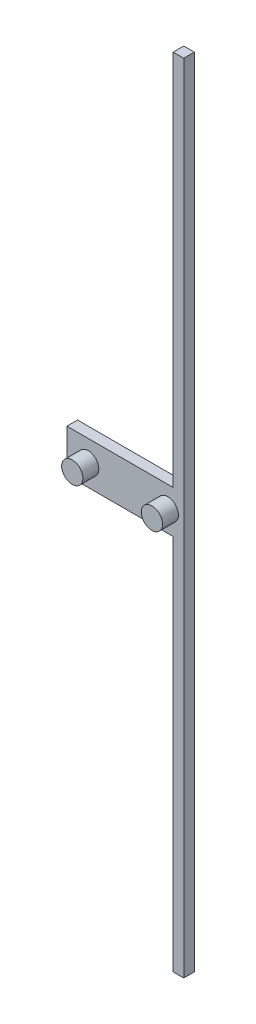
ISO-10303-21;
HEADER;
FILE_DESCRIPTION(('STEP AP214'),'2;1');
FILE_NAME('part.step','',(''),(''),'','','');
FILE_SCHEMA(('AUTOMOTIVE_DESIGN { 1 0 10303 214 1 1 1 1 }'));
ENDSEC;
DATA;
#1=APPLICATION_CONTEXT('core data for automotive mechanical design processes');
#2=APPLICATION_PROTOCOL_DEFINITION('international standard','automotive_design',2000,#1);
#3=PRODUCT_CONTEXT('',#1,'mechanical');
#4=PRODUCT('Part','Part','',(#3));
#5=PRODUCT_RELATED_PRODUCT_CATEGORY('part','',(#4));
#6=PRODUCT_DEFINITION_FORMATION('','',#4);
#7=PRODUCT_DEFINITION_CONTEXT('part definition',#1,'design');
#8=PRODUCT_DEFINITION('design','',#6,#7);
#9=PRODUCT_DEFINITION_SHAPE('','',#8);
#10=(LENGTH_UNIT() NAMED_UNIT(*) SI_UNIT(.MILLI.,.METRE.));
#11=(NAMED_UNIT(*) PLANE_ANGLE_UNIT() SI_UNIT($,.RADIAN.));
#12=(NAMED_UNIT(*) SI_UNIT($,.STERADIAN.) SOLID_ANGLE_UNIT());
#13=UNCERTAINTY_MEASURE_WITH_UNIT(LENGTH_MEASURE(1.E-05),#10,'distance_accuracy_value','');
#14=(GEOMETRIC_REPRESENTATION_CONTEXT(3) GLOBAL_UNCERTAINTY_ASSIGNED_CONTEXT((#13)) GLOBAL_UNIT_ASSIGNED_CONTEXT((#10,
#11,#12)) REPRESENTATION_CONTEXT('',''));
#15=CARTESIAN_POINT('',(0.,0.,0.));
#16=DIRECTION('',(0.,0.,1.));
#17=DIRECTION('',(1.,0.,0.));
#18=AXIS2_PLACEMENT_3D('',#15,#16,#17);
#19=CARTESIAN_POINT('',(0.,80.,20.));
#20=DIRECTION('',(0.,0.,-1.));
#21=DIRECTION('',(-1.,0.,0.));
#22=AXIS2_PLACEMENT_3D('',#19,#20,#21);
#23=PLANE('',#22);
#24=CARTESIAN_POINT('',(40.,40.,20.));
#25=DIRECTION('',(0.,0.,-1.));
#26=DIRECTION('',(-1.,0.,0.));
#27=AXIS2_PLACEMENT_3D('',#24,#25,#26);
#28=CIRCLE('',#27,20.);
#29=CARTESIAN_POINT('',(20.,40.,20.));
#30=VERTEX_POINT('',#29);
#31=EDGE_CURVE('E48',#30,#30,#28,.F.);
#32=ORIENTED_EDGE('',*,*,#31,.F.);
#33=EDGE_LOOP('',(#32));
#34=FACE_BOUND('',#33,.T.);
#35=DIRECTION('',(0.,-1.,0.));
#36=VECTOR('',#35,1.);
#37=CARTESIAN_POINT('',(0.,0.,20.));
#38=LINE('',#37,#36);
#39=CARTESIAN_POINT('',(0.,80.,20.));
#40=VERTEX_POINT('',#39);
#41=CARTESIAN_POINT('',(0.,0.,20.));
#42=VERTEX_POINT('',#41);
#43=EDGE_CURVE('E148',#40,#42,#38,.T.);
#44=ORIENTED_EDGE('',*,*,#43,.T.);
#45=DIRECTION('',(1.,0.,0.));
#46=VECTOR('',#45,1.);
#47=CARTESIAN_POINT('',(0.,0.,20.));
#48=LINE('',#47,#46);
#49=CARTESIAN_POINT('',(200.,0.,20.));
#50=VERTEX_POINT('',#49);
#51=EDGE_CURVE('E122',#42,#50,#48,.T.);
#52=ORIENTED_EDGE('',*,*,#51,.T.);
#53=DIRECTION('',(0.,-1.,0.));
#54=VECTOR('',#53,1.);
#55=CARTESIAN_POINT('',(200.,0.,20.));
#56=LINE('',#55,#54);
#57=CARTESIAN_POINT('',(200.,-710.,20.));
#58=VERTEX_POINT('',#57);
#59=EDGE_CURVE('E151',#50,#58,#56,.T.);
#60=ORIENTED_EDGE('',*,*,#59,.T.);
#61=DIRECTION('',(1.,0.,0.));
#62=VECTOR('',#61,1.);
#63=CARTESIAN_POINT('',(200.,-710.,20.));
#64=LINE('',#63,#62);
#65=CARTESIAN_POINT('',(220.,-710.,20.));
#66=VERTEX_POINT('',#65);
#67=EDGE_CURVE('E153',#58,#66,#64,.T.);
#68=ORIENTED_EDGE('',*,*,#67,.T.);
#69=DIRECTION('',(0.,1.,0.));
#70=VECTOR('',#69,1.);
#71=CARTESIAN_POINT('',(220.,790.,20.));
#72=LINE('',#71,#70);
#73=CARTESIAN_POINT('',(220.,790.,20.));
#74=VERTEX_POINT('',#73);
#75=EDGE_CURVE('E155',#66,#74,#72,.T.);
#76=ORIENTED_EDGE('',*,*,#75,.T.);
#77=DIRECTION('',(-1.,0.,0.));
#78=VECTOR('',#77,1.);
#79=CARTESIAN_POINT('',(200.,790.,20.));
#80=LINE('',#79,#78);
#81=CARTESIAN_POINT('',(200.,790.,20.));
#82=VERTEX_POINT('',#81);
#83=EDGE_CURVE('E157',#74,#82,#80,.T.);
#84=ORIENTED_EDGE('',*,*,#83,.T.);
#85=DIRECTION('',(0.,-1.,0.));
#86=VECTOR('',#85,1.);
#87=CARTESIAN_POINT('',(200.,790.,20.));
#88=LINE('',#87,#86);
#89=CARTESIAN_POINT('',(200.,80.,20.));
#90=VERTEX_POINT('',#89);
#91=EDGE_CURVE('E60',#82,#90,#88,.T.);
#92=ORIENTED_EDGE('',*,*,#91,.T.);
#93=DIRECTION('',(-1.,0.,0.));
#94=VECTOR('',#93,1.);
#95=CARTESIAN_POINT('',(0.,80.,20.));
#96=LINE('',#95,#94);
#97=EDGE_CURVE('E55',#90,#40,#96,.T.);
#98=ORIENTED_EDGE('',*,*,#97,.T.);
#99=EDGE_LOOP('',(#44,#52,#60,#68,#76,#84,#92,#98));
#100=FACE_BOUND('',#99,.T.);
#101=CARTESIAN_POINT('',(190.,40.,20.));
#102=DIRECTION('',(0.,0.,-1.));
#103=DIRECTION('',(-1.,0.,0.));
#104=AXIS2_PLACEMENT_3D('',#101,#102,#103);
#105=CIRCLE('',#104,20.);
#106=CARTESIAN_POINT('',(170.,40.,20.));
#107=VERTEX_POINT('',#106);
#108=EDGE_CURVE('E12',#107,#107,#105,.F.);
#109=ORIENTED_EDGE('',*,*,#108,.F.);
#110=EDGE_LOOP('',(#109));
#111=FACE_BOUND('',#110,.T.);
#112=ADVANCED_FACE('F40',(#34,#100,#111),#23,.F.);
#113=CARTESIAN_POINT('',(0.,0.,20.));
#114=DIRECTION('',(1.,0.,0.));
#115=DIRECTION('',(0.,0.,-1.));
#116=AXIS2_PLACEMENT_3D('',#113,#114,#115);
#117=PLANE('',#116);
#118=DIRECTION('',(0.,-1.,0.));
#119=VECTOR('',#118,1.);
#120=CARTESIAN_POINT('',(0.,0.,0.));
#121=LINE('',#120,#119);
#122=CARTESIAN_POINT('',(0.,80.,0.));
#123=VERTEX_POINT('',#122);
#124=CARTESIAN_POINT('',(0.,0.,0.));
#125=VERTEX_POINT('',#124);
#126=EDGE_CURVE('E112',#123,#125,#121,.T.);
#127=ORIENTED_EDGE('',*,*,#126,.T.);
#128=DIRECTION('',(0.,0.,-1.));
#129=VECTOR('',#128,1.);
#130=CARTESIAN_POINT('',(0.,0.,20.));
#131=LINE('',#130,#129);
#132=EDGE_CURVE('E120',#42,#125,#131,.T.);
#133=ORIENTED_EDGE('',*,*,#132,.F.);
#134=ORIENTED_EDGE('',*,*,#43,.F.);
#135=DIRECTION('',(0.,0.,-1.));
#136=VECTOR('',#135,1.);
#137=CARTESIAN_POINT('',(0.,80.,20.));
#138=LINE('',#137,#136);
#139=EDGE_CURVE('E128',#40,#123,#138,.T.);
#140=ORIENTED_EDGE('',*,*,#139,.T.);
#141=EDGE_LOOP('',(#127,#133,#134,#140));
#142=FACE_BOUND('',#141,.T.);
#143=ADVANCED_FACE('F42',(#142),#117,.F.);
#144=CARTESIAN_POINT('',(0.,0.,20.));
#145=DIRECTION('',(0.,1.,0.));
#146=DIRECTION('',(0.,0.,1.));
#147=AXIS2_PLACEMENT_3D('',#144,#145,#146);
#148=PLANE('',#147);
#149=DIRECTION('',(1.,0.,0.));
#150=VECTOR('',#149,1.);
#151=CARTESIAN_POINT('',(0.,0.,0.));
#152=LINE('',#151,#150);
#153=CARTESIAN_POINT('',(200.,0.,0.));
#154=VERTEX_POINT('',#153);
#155=EDGE_CURVE('E107',#125,#154,#152,.T.);
#156=ORIENTED_EDGE('',*,*,#155,.T.);
#157=DIRECTION('',(0.,0.,-1.));
#158=VECTOR('',#157,1.);
#159=CARTESIAN_POINT('',(200.,0.,20.));
#160=LINE('',#159,#158);
#161=EDGE_CURVE('E125',#50,#154,#160,.T.);
#162=ORIENTED_EDGE('',*,*,#161,.F.);
#163=ORIENTED_EDGE('',*,*,#51,.F.);
#164=ORIENTED_EDGE('',*,*,#132,.T.);
#165=EDGE_LOOP('',(#156,#162,#163,#164));
#166=FACE_BOUND('',#165,.T.);
#167=ADVANCED_FACE('F121',(#166),#148,.F.);
#168=CARTESIAN_POINT('',(200.,0.,20.));
#169=DIRECTION('',(1.,0.,0.));
#170=DIRECTION('',(0.,0.,-1.));
#171=AXIS2_PLACEMENT_3D('',#168,#169,#170);
#172=PLANE('',#171);
#173=DIRECTION('',(0.,-1.,0.));
#174=VECTOR('',#173,1.);
#175=CARTESIAN_POINT('',(200.,0.,0.));
#176=LINE('',#175,#174);
#177=CARTESIAN_POINT('',(200.,-710.,0.));
#178=VERTEX_POINT('',#177);
#179=EDGE_CURVE('E114',#154,#178,#176,.T.);
#180=ORIENTED_EDGE('',*,*,#179,.T.);
#181=DIRECTION('',(0.,0.,-1.));
#182=VECTOR('',#181,1.);
#183=CARTESIAN_POINT('',(200.,-710.,20.));
#184=LINE('',#183,#182);
#185=EDGE_CURVE('E174',#58,#178,#184,.T.);
#186=ORIENTED_EDGE('',*,*,#185,.F.);
#187=ORIENTED_EDGE('',*,*,#59,.F.);
#188=ORIENTED_EDGE('',*,*,#161,.T.);
#189=EDGE_LOOP('',(#180,#186,#187,#188));
#190=FACE_BOUND('',#189,.T.);
#191=ADVANCED_FACE('F227',(#190),#172,.F.);
#192=CARTESIAN_POINT('',(200.,-710.,20.));
#193=DIRECTION('',(0.,1.,0.));
#194=DIRECTION('',(-1.,0.,0.));
#195=AXIS2_PLACEMENT_3D('',#192,#193,#194);
#196=PLANE('',#195);
#197=DIRECTION('',(1.,0.,0.));
#198=VECTOR('',#197,1.);
#199=CARTESIAN_POINT('',(200.,-710.,0.));
#200=LINE('',#199,#198);
#201=CARTESIAN_POINT('',(220.,-710.,0.));
#202=VERTEX_POINT('',#201);
#203=EDGE_CURVE('E138',#178,#202,#200,.T.);
#204=ORIENTED_EDGE('',*,*,#203,.T.);
#205=DIRECTION('',(0.,0.,-1.));
#206=VECTOR('',#205,1.);
#207=CARTESIAN_POINT('',(220.,-710.,20.));
#208=LINE('',#207,#206);
#209=EDGE_CURVE('E171',#66,#202,#208,.T.);
#210=ORIENTED_EDGE('',*,*,#209,.F.);
#211=ORIENTED_EDGE('',*,*,#67,.F.);
#212=ORIENTED_EDGE('',*,*,#185,.T.);
#213=EDGE_LOOP('',(#204,#210,#211,#212));
#214=FACE_BOUND('',#213,.T.);
#215=ADVANCED_FACE('F223',(#214),#196,.F.);
#216=CARTESIAN_POINT('',(220.,790.,20.));
#217=DIRECTION('',(-1.,0.,0.));
#218=DIRECTION('',(0.,-1.,0.));
#219=AXIS2_PLACEMENT_3D('',#216,#217,#218);
#220=PLANE('',#219);
#221=DIRECTION('',(0.,1.,0.));
#222=VECTOR('',#221,1.);
#223=CARTESIAN_POINT('',(220.,790.,0.));
#224=LINE('',#223,#222);
#225=CARTESIAN_POINT('',(220.,790.,0.));
#226=VERTEX_POINT('',#225);
#227=EDGE_CURVE('E140',#202,#226,#224,.T.);
#228=ORIENTED_EDGE('',*,*,#227,.T.);
#229=DIRECTION('',(0.,0.,-1.));
#230=VECTOR('',#229,1.);
#231=CARTESIAN_POINT('',(220.,790.,20.));
#232=LINE('',#231,#230);
#233=EDGE_CURVE('E168',#74,#226,#232,.T.);
#234=ORIENTED_EDGE('',*,*,#233,.F.);
#235=ORIENTED_EDGE('',*,*,#75,.F.);
#236=ORIENTED_EDGE('',*,*,#209,.T.);
#237=EDGE_LOOP('',(#228,#234,#235,#236));
#238=FACE_BOUND('',#237,.T.);
#239=ADVANCED_FACE('F219',(#238),#220,.F.);
#240=CARTESIAN_POINT('',(200.,790.,20.));
#241=DIRECTION('',(0.,-1.,0.));
#242=DIRECTION('',(0.,0.,-1.));
#243=AXIS2_PLACEMENT_3D('',#240,#241,#242);
#244=PLANE('',#243);
#245=DIRECTION('',(-1.,0.,0.));
#246=VECTOR('',#245,1.);
#247=CARTESIAN_POINT('',(200.,790.,0.));
#248=LINE('',#247,#246);
#249=CARTESIAN_POINT('',(200.,790.,0.));
#250=VERTEX_POINT('',#249);
#251=EDGE_CURVE('E142',#226,#250,#248,.T.);
#252=ORIENTED_EDGE('',*,*,#251,.T.);
#253=DIRECTION('',(0.,0.,-1.));
#254=VECTOR('',#253,1.);
#255=CARTESIAN_POINT('',(200.,790.,20.));
#256=LINE('',#255,#254);
#257=EDGE_CURVE('E165',#82,#250,#256,.T.);
#258=ORIENTED_EDGE('',*,*,#257,.F.);
#259=ORIENTED_EDGE('',*,*,#83,.F.);
#260=ORIENTED_EDGE('',*,*,#233,.T.);
#261=EDGE_LOOP('',(#252,#258,#259,#260));
#262=FACE_BOUND('',#261,.T.);
#263=ADVANCED_FACE('F215',(#262),#244,.F.);
#264=CARTESIAN_POINT('',(200.,790.,20.));
#265=DIRECTION('',(1.,0.,0.));
#266=DIRECTION('',(0.,0.,-1.));
#267=AXIS2_PLACEMENT_3D('',#264,#265,#266);
#268=PLANE('',#267);
#269=DIRECTION('',(0.,-1.,0.));
#270=VECTOR('',#269,1.);
#271=CARTESIAN_POINT('',(200.,790.,0.));
#272=LINE('',#271,#270);
#273=CARTESIAN_POINT('',(200.,80.,0.));
#274=VERTEX_POINT('',#273);
#275=EDGE_CURVE('E144',#250,#274,#272,.T.);
#276=ORIENTED_EDGE('',*,*,#275,.T.);
#277=DIRECTION('',(0.,0.,-1.));
#278=VECTOR('',#277,1.);
#279=CARTESIAN_POINT('',(200.,80.,20.));
#280=LINE('',#279,#278);
#281=EDGE_CURVE('E162',#90,#274,#280,.T.);
#282=ORIENTED_EDGE('',*,*,#281,.F.);
#283=ORIENTED_EDGE('',*,*,#91,.F.);
#284=ORIENTED_EDGE('',*,*,#257,.T.);
#285=EDGE_LOOP('',(#276,#282,#283,#284));
#286=FACE_BOUND('',#285,.T.);
#287=ADVANCED_FACE('F211',(#286),#268,.F.);
#288=CARTESIAN_POINT('',(0.,80.,20.));
#289=DIRECTION('',(0.,-1.,0.));
#290=DIRECTION('',(0.,0.,-1.));
#291=AXIS2_PLACEMENT_3D('',#288,#289,#290);
#292=PLANE('',#291);
#293=DIRECTION('',(-1.,0.,0.));
#294=VECTOR('',#293,1.);
#295=CARTESIAN_POINT('',(0.,80.,0.));
#296=LINE('',#295,#294);
#297=EDGE_CURVE('E146',#274,#123,#296,.T.);
#298=ORIENTED_EDGE('',*,*,#297,.T.);
#299=ORIENTED_EDGE('',*,*,#139,.F.);
#300=ORIENTED_EDGE('',*,*,#97,.F.);
#301=ORIENTED_EDGE('',*,*,#281,.T.);
#302=EDGE_LOOP('',(#298,#299,#300,#301));
#303=FACE_BOUND('',#302,.T.);
#304=ADVANCED_FACE('F207',(#303),#292,.F.);
#305=CARTESIAN_POINT('',(0.,80.,0.));
#306=DIRECTION('',(0.,0.,-1.));
#307=DIRECTION('',(-1.,0.,0.));
#308=AXIS2_PLACEMENT_3D('',#305,#306,#307);
#309=PLANE('',#308);
#310=ORIENTED_EDGE('',*,*,#126,.F.);
#311=ORIENTED_EDGE('',*,*,#297,.F.);
#312=ORIENTED_EDGE('',*,*,#275,.F.);
#313=ORIENTED_EDGE('',*,*,#251,.F.);
#314=ORIENTED_EDGE('',*,*,#227,.F.);
#315=ORIENTED_EDGE('',*,*,#203,.F.);
#316=ORIENTED_EDGE('',*,*,#179,.F.);
#317=ORIENTED_EDGE('',*,*,#155,.F.);
#318=EDGE_LOOP('',(#310,#311,#312,#313,#314,#315,#316,#317));
#319=FACE_BOUND('',#318,.T.);
#320=ADVANCED_FACE('F109',(#319),#309,.T.);
#321=CARTESIAN_POINT('',(40.,40.,50.));
#322=DIRECTION('',(0.,0.,-1.));
#323=DIRECTION('',(-1.,0.,0.));
#324=AXIS2_PLACEMENT_3D('',#321,#322,#323);
#325=CYLINDRICAL_SURFACE('',#324,20.);
#326=CARTESIAN_POINT('',(40.,40.,50.));
#327=DIRECTION('',(0.,0.,1.));
#328=DIRECTION('',(1.,0.,0.));
#329=AXIS2_PLACEMENT_3D('',#326,#327,#328);
#330=CIRCLE('',#329,20.);
#331=CARTESIAN_POINT('',(60.,40.,50.));
#332=VERTEX_POINT('',#331);
#333=EDGE_CURVE('E129',#332,#332,#330,.T.);
#334=ORIENTED_EDGE('',*,*,#333,.F.);
#335=EDGE_LOOP('',(#334));
#336=FACE_BOUND('',#335,.T.);
#337=ORIENTED_EDGE('',*,*,#31,.T.);
#338=EDGE_LOOP('',(#337));
#339=FACE_BOUND('',#338,.T.);
#340=ADVANCED_FACE('F180',(#336,#339),#325,.T.);
#341=CARTESIAN_POINT('',(40.,40.,50.));
#342=DIRECTION('',(0.,0.,1.));
#343=DIRECTION('',(1.,0.,0.));
#344=AXIS2_PLACEMENT_3D('',#341,#342,#343);
#345=PLANE('',#344);
#346=ORIENTED_EDGE('',*,*,#333,.T.);
#347=EDGE_LOOP('',(#346));
#348=FACE_BOUND('',#347,.T.);
#349=ADVANCED_FACE('F190',(#348),#345,.T.);
#350=CARTESIAN_POINT('',(190.,40.,50.));
#351=DIRECTION('',(0.,0.,-1.));
#352=DIRECTION('',(-1.,0.,0.));
#353=AXIS2_PLACEMENT_3D('',#350,#351,#352);
#354=CYLINDRICAL_SURFACE('',#353,20.);
#355=CARTESIAN_POINT('',(190.,40.,50.));
#356=DIRECTION('',(0.,0.,1.));
#357=DIRECTION('',(1.,0.,0.));
#358=AXIS2_PLACEMENT_3D('',#355,#356,#357);
#359=CIRCLE('',#358,20.);
#360=CARTESIAN_POINT('',(210.,40.,50.));
#361=VERTEX_POINT('',#360);
#362=EDGE_CURVE('E133',#361,#361,#359,.T.);
#363=ORIENTED_EDGE('',*,*,#362,.F.);
#364=EDGE_LOOP('',(#363));
#365=FACE_BOUND('',#364,.T.);
#366=ORIENTED_EDGE('',*,*,#108,.T.);
#367=EDGE_LOOP('',(#366));
#368=FACE_BOUND('',#367,.T.);
#369=ADVANCED_FACE('F187',(#365,#368),#354,.T.);
#370=CARTESIAN_POINT('',(190.,40.,50.));
#371=DIRECTION('',(0.,0.,1.));
#372=DIRECTION('',(1.,0.,0.));
#373=AXIS2_PLACEMENT_3D('',#370,#371,#372);
#374=PLANE('',#373);
#375=ORIENTED_EDGE('',*,*,#362,.T.);
#376=EDGE_LOOP('',(#375));
#377=FACE_BOUND('',#376,.T.);
#378=ADVANCED_FACE('F189',(#377),#374,.T.);
#379=CLOSED_SHELL('',(#112,#143,#167,#191,#215,#239,#263,#287,#304,#320,#340,#349,#369,#378));
#380=MANIFOLD_SOLID_BREP('B2',#379);
#381=ADVANCED_BREP_SHAPE_REPRESENTATION('',(#18,#380),#14);
#382=SHAPE_DEFINITION_REPRESENTATION(#9,#381);
ENDSEC;
END-ISO-10303-21;
